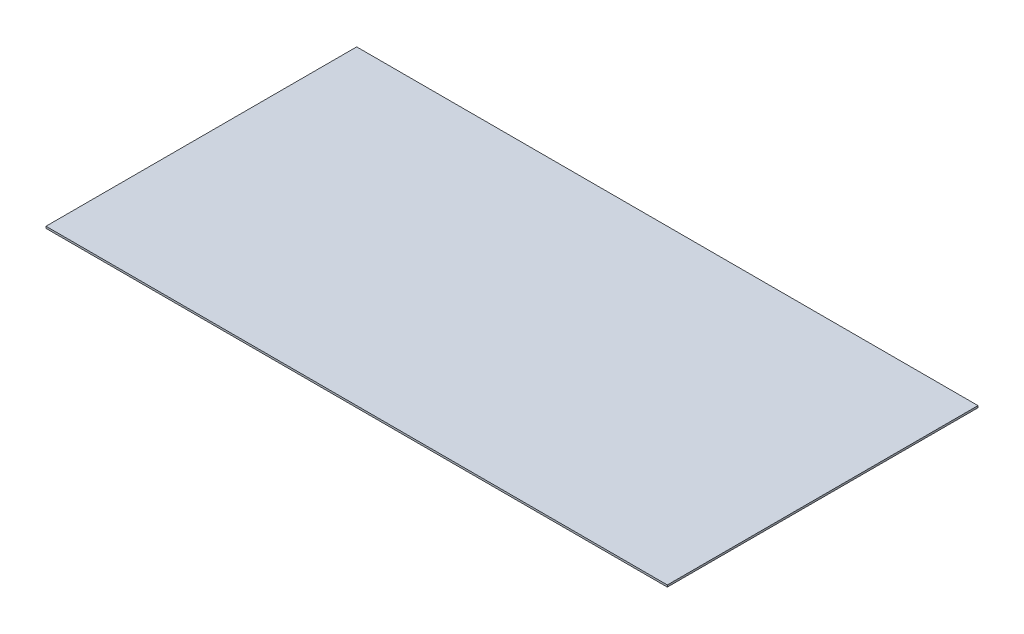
ISO-10303-21;
HEADER;
FILE_DESCRIPTION(('STEP AP214'),'2;1');
FILE_NAME('part.step','',(''),(''),'','','');
FILE_SCHEMA(('AUTOMOTIVE_DESIGN { 1 0 10303 214 1 1 1 1 }'));
ENDSEC;
DATA;
#1=APPLICATION_CONTEXT('core data for automotive mechanical design processes');
#2=APPLICATION_PROTOCOL_DEFINITION('international standard','automotive_design',2000,#1);
#3=PRODUCT_CONTEXT('',#1,'mechanical');
#4=PRODUCT('Part','Part','',(#3));
#5=PRODUCT_RELATED_PRODUCT_CATEGORY('part','',(#4));
#6=PRODUCT_DEFINITION_FORMATION('','',#4);
#7=PRODUCT_DEFINITION_CONTEXT('part definition',#1,'design');
#8=PRODUCT_DEFINITION('design','',#6,#7);
#9=PRODUCT_DEFINITION_SHAPE('','',#8);
#10=(LENGTH_UNIT() NAMED_UNIT(*) SI_UNIT(.MILLI.,.METRE.));
#11=(NAMED_UNIT(*) PLANE_ANGLE_UNIT() SI_UNIT($,.RADIAN.));
#12=(NAMED_UNIT(*) SI_UNIT($,.STERADIAN.) SOLID_ANGLE_UNIT());
#13=UNCERTAINTY_MEASURE_WITH_UNIT(LENGTH_MEASURE(1.E-05),#10,'distance_accuracy_value','');
#14=(GEOMETRIC_REPRESENTATION_CONTEXT(3) GLOBAL_UNCERTAINTY_ASSIGNED_CONTEXT((#13)) GLOBAL_UNIT_ASSIGNED_CONTEXT((#10,
#11,#12)) REPRESENTATION_CONTEXT('',''));
#15=CARTESIAN_POINT('',(0.,0.,0.));
#16=DIRECTION('',(0.,0.,1.));
#17=DIRECTION('',(1.,0.,0.));
#18=AXIS2_PLACEMENT_3D('',#15,#16,#17);
#19=CARTESIAN_POINT('',(-489.999999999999,2.9999999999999,-490.));
#20=DIRECTION('',(1.,0.,0.));
#21=DIRECTION('',(0.,0.,-1.));
#22=AXIS2_PLACEMENT_3D('',#19,#20,#21);
#23=PLANE('',#22);
#24=DIRECTION('',(0.,0.,1.));
#25=VECTOR('',#24,1.);
#26=CARTESIAN_POINT('',(-489.999999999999,-1.08801856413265E-13,-490.));
#27=LINE('',#26,#25);
#28=CARTESIAN_POINT('',(-489.999999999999,-1.08801856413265E-13,-490.));
#29=VERTEX_POINT('',#28);
#30=CARTESIAN_POINT('',(-489.999999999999,-1.08801856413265E-13,0.));
#31=VERTEX_POINT('',#30);
#32=EDGE_CURVE('E95',#29,#31,#27,.T.);
#33=ORIENTED_EDGE('',*,*,#32,.T.);
#34=DIRECTION('',(0.,-1.,0.));
#35=VECTOR('',#34,1.);
#36=CARTESIAN_POINT('',(-489.999999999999,2.9999999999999,0.));
#37=LINE('',#36,#35);
#38=CARTESIAN_POINT('',(-489.999999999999,2.9999999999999,0.));
#39=VERTEX_POINT('',#38);
#40=EDGE_CURVE('E11',#39,#31,#37,.T.);
#41=ORIENTED_EDGE('',*,*,#40,.F.);
#42=DIRECTION('',(0.,0.,1.));
#43=VECTOR('',#42,1.);
#44=CARTESIAN_POINT('',(-489.999999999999,2.9999999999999,-490.));
#45=LINE('',#44,#43);
#46=CARTESIAN_POINT('',(-489.999999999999,2.9999999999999,-490.));
#47=VERTEX_POINT('',#46);
#48=EDGE_CURVE('E83',#47,#39,#45,.T.);
#49=ORIENTED_EDGE('',*,*,#48,.F.);
#50=DIRECTION('',(0.,-1.,0.));
#51=VECTOR('',#50,1.);
#52=CARTESIAN_POINT('',(-489.999999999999,2.9999999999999,-490.));
#53=LINE('',#52,#51);
#54=EDGE_CURVE('E91',#47,#29,#53,.T.);
#55=ORIENTED_EDGE('',*,*,#54,.T.);
#56=EDGE_LOOP('',(#33,#41,#49,#55));
#57=FACE_BOUND('',#56,.T.);
#58=ADVANCED_FACE('F32',(#57),#23,.F.);
#59=CARTESIAN_POINT('',(-489.999999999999,2.9999999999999,0.));
#60=DIRECTION('',(0.,0.,-1.));
#61=DIRECTION('',(-1.,0.,0.));
#62=AXIS2_PLACEMENT_3D('',#59,#60,#61);
#63=PLANE('',#62);
#64=DIRECTION('',(1.,0.,0.));
#65=VECTOR('',#64,1.);
#66=CARTESIAN_POINT('',(-489.999999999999,-1.08801856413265E-13,0.));
#67=LINE('',#66,#65);
#68=CARTESIAN_POINT('',(489.999999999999,1.08801856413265E-13,0.));
#69=VERTEX_POINT('',#68);
#70=EDGE_CURVE('E87',#31,#69,#67,.T.);
#71=ORIENTED_EDGE('',*,*,#70,.T.);
#72=DIRECTION('',(0.,-1.,0.));
#73=VECTOR('',#72,1.);
#74=CARTESIAN_POINT('',(489.999999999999,3.00000000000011,0.));
#75=LINE('',#74,#73);
#76=CARTESIAN_POINT('',(489.999999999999,3.00000000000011,0.));
#77=VERTEX_POINT('',#76);
#78=EDGE_CURVE('E40',#77,#69,#75,.T.);
#79=ORIENTED_EDGE('',*,*,#78,.F.);
#80=DIRECTION('',(1.,0.,0.));
#81=VECTOR('',#80,1.);
#82=CARTESIAN_POINT('',(-489.999999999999,2.9999999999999,0.));
#83=LINE('',#82,#81);
#84=EDGE_CURVE('E78',#39,#77,#83,.T.);
#85=ORIENTED_EDGE('',*,*,#84,.F.);
#86=ORIENTED_EDGE('',*,*,#40,.T.);
#87=EDGE_LOOP('',(#71,#79,#85,#86));
#88=FACE_BOUND('',#87,.T.);
#89=ADVANCED_FACE('F86',(#88),#63,.F.);
#90=CARTESIAN_POINT('',(489.999999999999,3.00000000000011,-490.));
#91=DIRECTION('',(-1.,0.,0.));
#92=DIRECTION('',(0.,0.,1.));
#93=AXIS2_PLACEMENT_3D('',#90,#91,#92);
#94=PLANE('',#93);
#95=DIRECTION('',(0.,0.,-1.));
#96=VECTOR('',#95,1.);
#97=CARTESIAN_POINT('',(489.999999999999,1.08801856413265E-13,-490.));
#98=LINE('',#97,#96);
#99=CARTESIAN_POINT('',(489.999999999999,1.08801856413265E-13,-490.));
#100=VERTEX_POINT('',#99);
#101=EDGE_CURVE('E65',#69,#100,#98,.T.);
#102=ORIENTED_EDGE('',*,*,#101,.T.);
#103=DIRECTION('',(0.,-1.,0.));
#104=VECTOR('',#103,1.);
#105=CARTESIAN_POINT('',(489.999999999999,3.00000000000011,-490.));
#106=LINE('',#105,#104);
#107=CARTESIAN_POINT('',(489.999999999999,3.00000000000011,-490.));
#108=VERTEX_POINT('',#107);
#109=EDGE_CURVE('E88',#108,#100,#106,.T.);
#110=ORIENTED_EDGE('',*,*,#109,.F.);
#111=DIRECTION('',(0.,0.,-1.));
#112=VECTOR('',#111,1.);
#113=CARTESIAN_POINT('',(489.999999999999,3.00000000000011,-490.));
#114=LINE('',#113,#112);
#115=EDGE_CURVE('E81',#77,#108,#114,.T.);
#116=ORIENTED_EDGE('',*,*,#115,.F.);
#117=ORIENTED_EDGE('',*,*,#78,.T.);
#118=EDGE_LOOP('',(#102,#110,#116,#117));
#119=FACE_BOUND('',#118,.T.);
#120=ADVANCED_FACE('F89',(#119),#94,.F.);
#121=CARTESIAN_POINT('',(-489.999999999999,2.9999999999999,-490.));
#122=DIRECTION('',(0.,0.,1.));
#123=DIRECTION('',(1.,0.,0.));
#124=AXIS2_PLACEMENT_3D('',#121,#122,#123);
#125=PLANE('',#124);
#126=DIRECTION('',(-1.,0.,0.));
#127=VECTOR('',#126,1.);
#128=CARTESIAN_POINT('',(-489.999999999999,-1.08801856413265E-13,-490.));
#129=LINE('',#128,#127);
#130=EDGE_CURVE('E71',#100,#29,#129,.T.);
#131=ORIENTED_EDGE('',*,*,#130,.T.);
#132=ORIENTED_EDGE('',*,*,#54,.F.);
#133=DIRECTION('',(-1.,0.,0.));
#134=VECTOR('',#133,1.);
#135=CARTESIAN_POINT('',(-489.999999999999,2.9999999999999,-490.));
#136=LINE('',#135,#134);
#137=EDGE_CURVE('E48',#108,#47,#136,.T.);
#138=ORIENTED_EDGE('',*,*,#137,.F.);
#139=ORIENTED_EDGE('',*,*,#109,.T.);
#140=EDGE_LOOP('',(#131,#132,#138,#139));
#141=FACE_BOUND('',#140,.T.);
#142=ADVANCED_FACE('F102',(#141),#125,.F.);
#143=CARTESIAN_POINT('',(0.,3.,0.));
#144=DIRECTION('',(0.,1.,0.));
#145=DIRECTION('',(0.,0.,1.));
#146=AXIS2_PLACEMENT_3D('',#143,#144,#145);
#147=PLANE('',#146);
#148=ORIENTED_EDGE('',*,*,#48,.T.);
#149=ORIENTED_EDGE('',*,*,#84,.T.);
#150=ORIENTED_EDGE('',*,*,#115,.T.);
#151=ORIENTED_EDGE('',*,*,#137,.T.);
#152=EDGE_LOOP('',(#148,#149,#150,#151));
#153=FACE_BOUND('',#152,.T.);
#154=ADVANCED_FACE('F79',(#153),#147,.T.);
#155=CARTESIAN_POINT('',(0.,0.,0.));
#156=DIRECTION('',(0.,1.,0.));
#157=DIRECTION('',(0.,0.,1.));
#158=AXIS2_PLACEMENT_3D('',#155,#156,#157);
#159=PLANE('',#158);
#160=ORIENTED_EDGE('',*,*,#32,.F.);
#161=ORIENTED_EDGE('',*,*,#130,.F.);
#162=ORIENTED_EDGE('',*,*,#101,.F.);
#163=ORIENTED_EDGE('',*,*,#70,.F.);
#164=EDGE_LOOP('',(#160,#161,#162,#163));
#165=FACE_BOUND('',#164,.T.);
#166=ADVANCED_FACE('F105',(#165),#159,.F.);
#167=CLOSED_SHELL('',(#58,#89,#120,#142,#154,#166));
#168=MANIFOLD_SOLID_BREP('B2',#167);
#169=ADVANCED_BREP_SHAPE_REPRESENTATION('',(#18,#168),#14);
#170=SHAPE_DEFINITION_REPRESENTATION(#9,#169);
ENDSEC;
END-ISO-10303-21;
